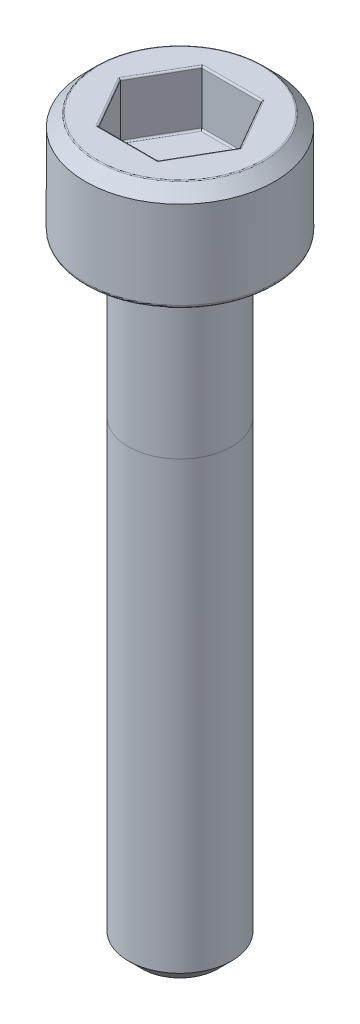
from build123d import *

# Parameters (mm, degrees)
CHAMFER1_SIZE      = 0.35
CHAMFER2_SIZE      = 0.4
FILLET1_R          = 0.1
CUT_EXTRUDE1_DEPTH = 1.6
FILLET2_R          = 0.05


with BuildPart() as part:
    # Sketch1 → Base-Revolve (revolve)
    with BuildSketch(Plane.XY, mode=Mode.PRIVATE) as base_revolve_sk:
        Polygon((0, 3), (2.75, 3), (2.75, 0), (1.5, 0), (1.5, -18), (0, -18), align=None)
    revolve(base_revolve_sk.sketch.rotate(Axis((0, 71.628, 0), (0, -1, 0)), 90), axis=Axis((0, 71.628, 0), (0, -1, 0)))

    # Chamfer1
    chamfer1_edges = [part.edges().sort_by_distance(p)[0] for p in [
        (0, 3, -2.75),
    ]]
    chamfer(chamfer1_edges, length=CHAMFER1_SIZE)

    # Chamfer2
    chamfer2_edges = [part.edges().sort_by_distance(p)[0] for p in [
        (0, -18, -1.5),
    ]]
    chamfer(chamfer2_edges, length=CHAMFER2_SIZE)

    # Fillet1
    fillet1_edges = [part.edges().sort_by_distance(p)[0] for p in [
        (0, 0, -1.5),
        (0, 0, -2.75),
    ]]
    fillet(fillet1_edges, radius=FILLET1_R)

    # Sketch2 → Cut-Extrude1 (cut)
    with BuildSketch(Plane(origin=(0, 3, 0), x_dir=(-1, 0, 0), z_dir=(0, 1, 0))):
        Polygon((-0.866025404, 1.5), (-1.732050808, 0), (-0.866025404, -1.5), (0.866025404, -1.5), (1.732050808, 0), (0.866025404, 1.5), align=None)
    extrude(amount=-CUT_EXTRUDE1_DEPTH, mode=Mode.SUBTRACT)

    # Fillet2
    fillet2_edges = [part.edges().sort_by_distance(p)[0] for p in [
        (0, 3, -2.4),
        (1.299038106, 3, 0.75),
        (1.299038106, 3, -0.75),
        (0, 3, -1.5),
        (-1.299038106, 3, -0.75),
        (-1.299038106, 3, 0.75),
        (0, 3, 1.5),
        (1.299038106, 1.4, 0.75),
        (1.299038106, 1.4, -0.75),
        (0, 1.4, -1.5),
        (-1.299038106, 1.4, -0.75),
        (-1.299038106, 1.4, 0.75),
        (0, 1.4, 1.5),
    ]]
    fillet(fillet2_edges, radius=FILLET2_R)


solid = part.part
